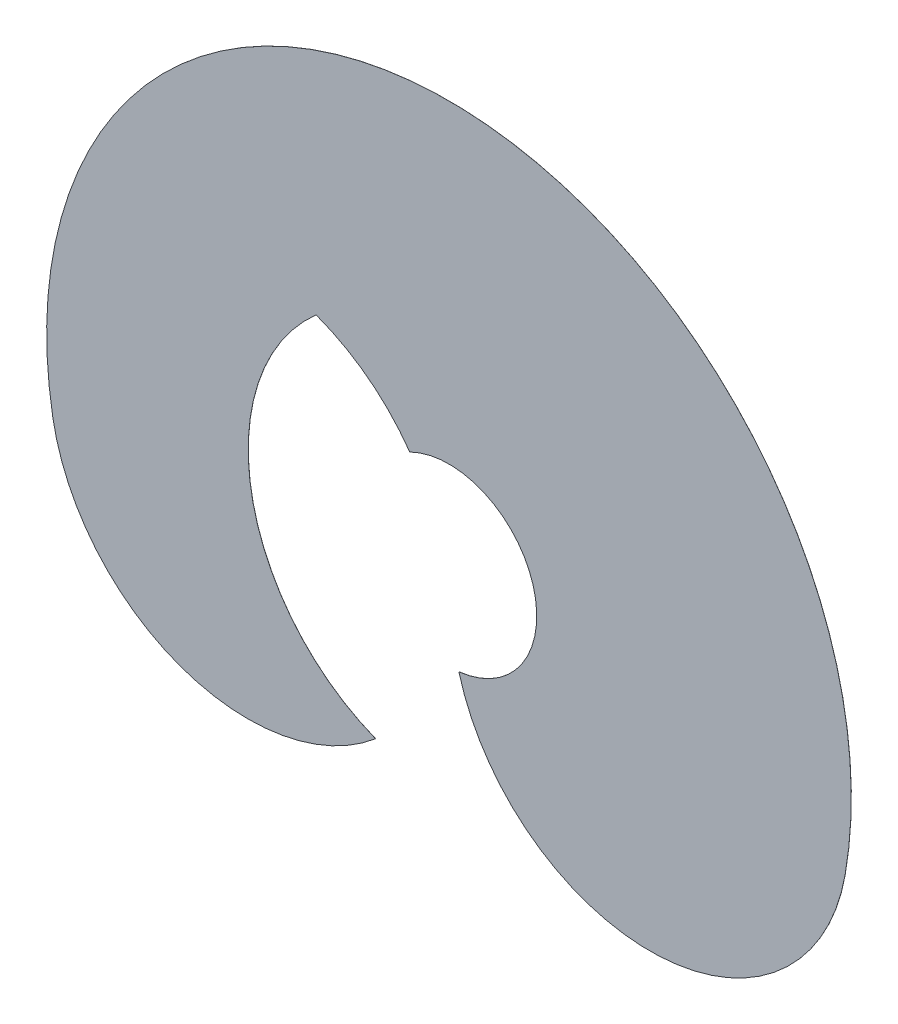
from build123d import *

# Parameters (mm, degrees)
EXTRUDE_1_DEPTH = 0.5


with BuildPart() as part:
    # Sketch 1 → Extrude 1 (new body)
    with BuildSketch(Plane.XY):
        with BuildLine():
            ThreePointArc((2519.749310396, 210.281957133), (250, 2915.263852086), (-2019.749310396, 210.281957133))
            ThreePointArc((-2019.749310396, 210.281957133), (-1288.928915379, -659.509094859), (-170.519990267, -460.018743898))
            ThreePointArc((-170.519990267, -460.018743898), (-882.677673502, 410.778365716), (-511.298505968, 1472.632256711))
            ThreePointArc((-511.298505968, 1472.632256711), (-211.424606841, 1307.600324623), (25.597074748, 1060.657787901))
            ThreePointArc((25.597074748, 1060.657787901), (732.286038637, 753.324661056), (306.906741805, 110.739727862))
            ThreePointArc((306.906741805, 110.739727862), (1453.219575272, -726.285834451), (2519.749310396, 210.281957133))
        make_face()
    extrude(amount=EXTRUDE_1_DEPTH)


solid = part.part
